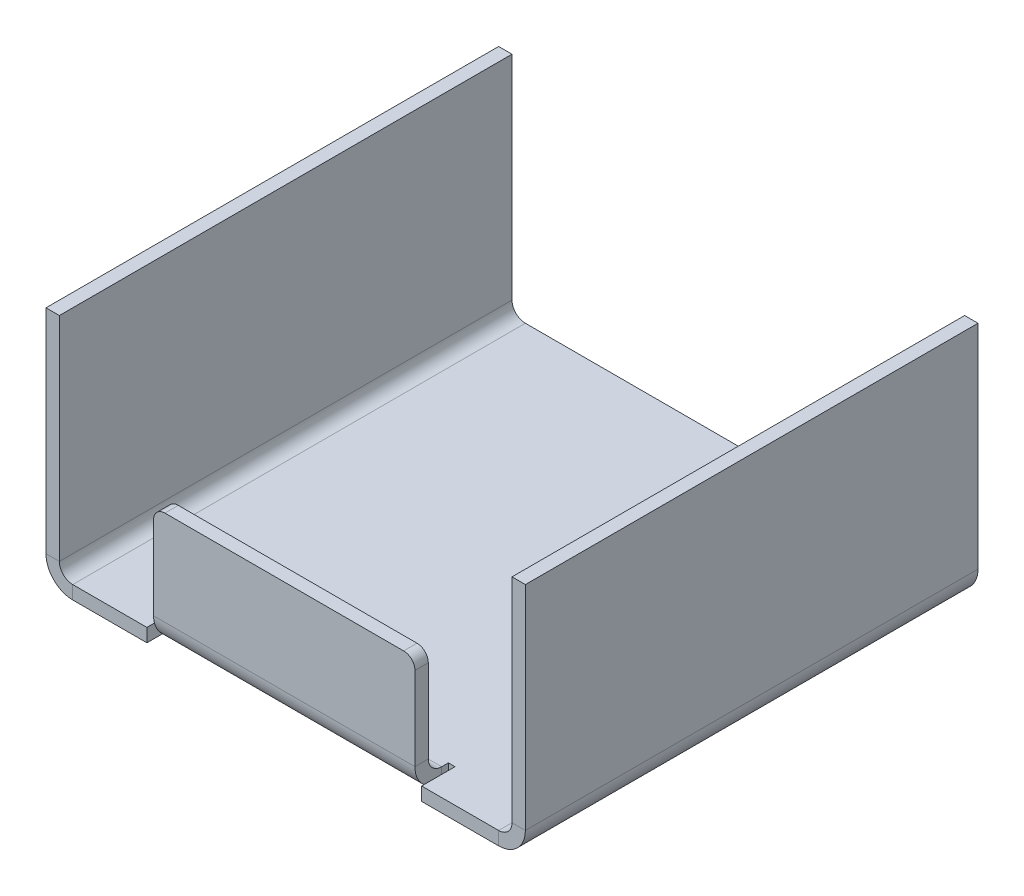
ISO-10303-21;
HEADER;
FILE_DESCRIPTION(('STEP AP214'),'2;1');
FILE_NAME('part.step','',(''),(''),'','','');
FILE_SCHEMA(('AUTOMOTIVE_DESIGN { 1 0 10303 214 1 1 1 1 }'));
ENDSEC;
DATA;
#1=APPLICATION_CONTEXT('core data for automotive mechanical design processes');
#2=APPLICATION_PROTOCOL_DEFINITION('international standard','automotive_design',2000,#1);
#3=PRODUCT_CONTEXT('',#1,'mechanical');
#4=PRODUCT('Part','Part','',(#3));
#5=PRODUCT_RELATED_PRODUCT_CATEGORY('part','',(#4));
#6=PRODUCT_DEFINITION_FORMATION('','',#4);
#7=PRODUCT_DEFINITION_CONTEXT('part definition',#1,'design');
#8=PRODUCT_DEFINITION('design','',#6,#7);
#9=PRODUCT_DEFINITION_SHAPE('','',#8);
#10=(LENGTH_UNIT() NAMED_UNIT(*) SI_UNIT(.MILLI.,.METRE.));
#11=(NAMED_UNIT(*) PLANE_ANGLE_UNIT() SI_UNIT($,.RADIAN.));
#12=(NAMED_UNIT(*) SI_UNIT($,.STERADIAN.) SOLID_ANGLE_UNIT());
#13=UNCERTAINTY_MEASURE_WITH_UNIT(LENGTH_MEASURE(1.E-05),#10,'distance_accuracy_value','');
#14=(GEOMETRIC_REPRESENTATION_CONTEXT(3) GLOBAL_UNCERTAINTY_ASSIGNED_CONTEXT((#13)) GLOBAL_UNIT_ASSIGNED_CONTEXT((#10,
#11,#12)) REPRESENTATION_CONTEXT('',''));
#15=CARTESIAN_POINT('',(0.,0.,0.));
#16=DIRECTION('',(0.,0.,1.));
#17=DIRECTION('',(1.,0.,0.));
#18=AXIS2_PLACEMENT_3D('',#15,#16,#17);
#19=CARTESIAN_POINT('',(-53.8,3.,50.8));
#20=DIRECTION('',(0.,0.,1.));
#21=DIRECTION('',(1.,0.,0.));
#22=AXIS2_PLACEMENT_3D('',#19,#20,#21);
#23=PLANE('',#22);
#24=DIRECTION('',(1.,0.,0.));
#25=VECTOR('',#24,1.);
#26=CARTESIAN_POINT('',(-50.8,0.,50.8));
#27=LINE('',#26,#25);
#28=CARTESIAN_POINT('',(30.5126051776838,0.,50.8));
#29=VERTEX_POINT('',#28);
#30=CARTESIAN_POINT('',(47.8,0.,50.8));
#31=VERTEX_POINT('',#30);
#32=EDGE_CURVE('E346',#29,#31,#27,.T.);
#33=ORIENTED_EDGE('',*,*,#32,.F.);
#34=DIRECTION('',(0.,-1.,0.));
#35=VECTOR('',#34,1.);
#36=CARTESIAN_POINT('',(30.5126051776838,0.,50.8));
#37=LINE('',#36,#35);
#38=CARTESIAN_POINT('',(30.5126051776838,-3.,50.8));
#39=VERTEX_POINT('',#38);
#40=EDGE_CURVE('E307',#29,#39,#37,.T.);
#41=ORIENTED_EDGE('',*,*,#40,.T.);
#42=DIRECTION('',(1.,0.,0.));
#43=VECTOR('',#42,1.);
#44=CARTESIAN_POINT('',(-50.8,-3.,50.8));
#45=LINE('',#44,#43);
#46=CARTESIAN_POINT('',(47.8,-3.,50.8));
#47=VERTEX_POINT('',#46);
#48=EDGE_CURVE('E365',#39,#47,#45,.T.);
#49=ORIENTED_EDGE('',*,*,#48,.T.);
#50=DIRECTION('',(0.,1.,0.));
#51=VECTOR('',#50,1.);
#52=CARTESIAN_POINT('',(47.8,-3.,50.8));
#53=LINE('',#52,#51);
#54=EDGE_CURVE('E442',#47,#31,#53,.T.);
#55=ORIENTED_EDGE('',*,*,#54,.T.);
#56=EDGE_LOOP('',(#33,#41,#49,#55));
#57=FACE_BOUND('',#56,.T.);
#58=ADVANCED_FACE('F59',(#57),#23,.T.);
#59=CARTESIAN_POINT('',(-47.8,-3.,50.8));
#60=VERTEX_POINT('',#59);
#61=CARTESIAN_POINT('',(-31.1512524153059,-3.,50.8));
#62=VERTEX_POINT('',#61);
#63=EDGE_CURVE('E366',#60,#62,#45,.T.);
#64=ORIENTED_EDGE('',*,*,#63,.T.);
#65=DIRECTION('',(0.,-1.,0.));
#66=VECTOR('',#65,1.);
#67=CARTESIAN_POINT('',(-31.1512524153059,0.,50.8));
#68=LINE('',#67,#66);
#69=CARTESIAN_POINT('',(-31.1512524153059,0.,50.8));
#70=VERTEX_POINT('',#69);
#71=EDGE_CURVE('E322',#70,#62,#68,.T.);
#72=ORIENTED_EDGE('',*,*,#71,.F.);
#73=CARTESIAN_POINT('',(-47.8,0.,50.8));
#74=VERTEX_POINT('',#73);
#75=EDGE_CURVE('E347',#74,#70,#27,.T.);
#76=ORIENTED_EDGE('',*,*,#75,.F.);
#77=DIRECTION('',(0.,-1.,0.));
#78=VECTOR('',#77,1.);
#79=CARTESIAN_POINT('',(-47.8,0.,50.8));
#80=LINE('',#79,#78);
#81=EDGE_CURVE('E453',#74,#60,#80,.T.);
#82=ORIENTED_EDGE('',*,*,#81,.T.);
#83=EDGE_LOOP('',(#64,#72,#76,#82));
#84=FACE_BOUND('',#83,.T.);
#85=ADVANCED_FACE('F524',(#84),#23,.T.);
#86=CARTESIAN_POINT('',(-50.8,0.,50.8));
#87=DIRECTION('',(0.,1.,0.));
#88=DIRECTION('',(0.,0.,1.));
#89=AXIS2_PLACEMENT_3D('',#86,#87,#88);
#90=PLANE('',#89);
#91=DIRECTION('',(-1.,0.,0.));
#92=VECTOR('',#91,1.);
#93=CARTESIAN_POINT('',(30.5126051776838,0.,43.3));
#94=LINE('',#93,#92);
#95=CARTESIAN_POINT('',(30.5126051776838,0.,43.3));
#96=VERTEX_POINT('',#95);
#97=CARTESIAN_POINT('',(29.0126051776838,0.,43.3));
#98=VERTEX_POINT('',#97);
#99=EDGE_CURVE('E74',#96,#98,#94,.T.);
#100=ORIENTED_EDGE('',*,*,#99,.F.);
#101=DIRECTION('',(0.,0.,-1.));
#102=VECTOR('',#101,1.);
#103=CARTESIAN_POINT('',(30.5126051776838,0.,50.8));
#104=LINE('',#103,#102);
#105=EDGE_CURVE('E303',#29,#96,#104,.T.);
#106=ORIENTED_EDGE('',*,*,#105,.F.);
#107=ORIENTED_EDGE('',*,*,#32,.T.);
#108=DIRECTION('',(0.,0.,-1.));
#109=VECTOR('',#108,1.);
#110=CARTESIAN_POINT('',(47.8,0.,50.8));
#111=LINE('',#110,#109);
#112=CARTESIAN_POINT('',(47.8,0.,-50.8));
#113=VERTEX_POINT('',#112);
#114=EDGE_CURVE('E428',#31,#113,#111,.T.);
#115=ORIENTED_EDGE('',*,*,#114,.T.);
#116=DIRECTION('',(1.,0.,0.));
#117=VECTOR('',#116,1.);
#118=CARTESIAN_POINT('',(-50.8,0.,-50.8));
#119=LINE('',#118,#117);
#120=CARTESIAN_POINT('',(-47.8,0.,-50.8));
#121=VERTEX_POINT('',#120);
#122=EDGE_CURVE('E384',#121,#113,#119,.T.);
#123=ORIENTED_EDGE('',*,*,#122,.F.);
#124=DIRECTION('',(0.,0.,-1.));
#125=VECTOR('',#124,1.);
#126=CARTESIAN_POINT('',(-47.8,0.,50.8));
#127=LINE('',#126,#125);
#128=EDGE_CURVE('E425',#74,#121,#127,.T.);
#129=ORIENTED_EDGE('',*,*,#128,.F.);
#130=ORIENTED_EDGE('',*,*,#75,.T.);
#131=DIRECTION('',(0.,0.,1.));
#132=VECTOR('',#131,1.);
#133=CARTESIAN_POINT('',(-31.1512524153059,0.,43.3));
#134=LINE('',#133,#132);
#135=CARTESIAN_POINT('',(-31.1512524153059,0.,43.3));
#136=VERTEX_POINT('',#135);
#137=EDGE_CURVE('E319',#136,#70,#134,.T.);
#138=ORIENTED_EDGE('',*,*,#137,.F.);
#139=DIRECTION('',(-1.,0.,0.));
#140=VECTOR('',#139,1.);
#141=CARTESIAN_POINT('',(-29.6512524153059,0.,43.3));
#142=LINE('',#141,#140);
#143=CARTESIAN_POINT('',(-29.6512524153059,0.,43.3));
#144=VERTEX_POINT('',#143);
#145=EDGE_CURVE('E315',#144,#136,#142,.T.);
#146=ORIENTED_EDGE('',*,*,#145,.F.);
#147=DIRECTION('',(0.,0.,-1.));
#148=VECTOR('',#147,1.);
#149=CARTESIAN_POINT('',(-29.6512524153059,0.,44.8));
#150=LINE('',#149,#148);
#151=CARTESIAN_POINT('',(-29.6512524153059,0.,44.8));
#152=VERTEX_POINT('',#151);
#153=EDGE_CURVE('E312',#152,#144,#150,.T.);
#154=ORIENTED_EDGE('',*,*,#153,.F.);
#155=DIRECTION('',(1.,0.,0.));
#156=VECTOR('',#155,1.);
#157=CARTESIAN_POINT('',(29.0126051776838,0.,44.8));
#158=LINE('',#157,#156);
#159=CARTESIAN_POINT('',(29.0126051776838,0.,44.8));
#160=VERTEX_POINT('',#159);
#161=EDGE_CURVE('E291',#160,#152,#158,.F.);
#162=ORIENTED_EDGE('',*,*,#161,.F.);
#163=DIRECTION('',(0.,0.,1.));
#164=VECTOR('',#163,1.);
#165=CARTESIAN_POINT('',(29.0126051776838,0.,43.3));
#166=LINE('',#165,#164);
#167=EDGE_CURVE('E79',#98,#160,#166,.T.);
#168=ORIENTED_EDGE('',*,*,#167,.F.);
#169=EDGE_LOOP('',(#100,#106,#107,#115,#123,#129,#130,#138,#146,#154,#162,#168));
#170=FACE_BOUND('',#169,.T.);
#171=ADVANCED_FACE('F475',(#170),#90,.T.);
#172=CARTESIAN_POINT('',(-50.8,-3.,50.8));
#173=DIRECTION('',(0.,1.,0.));
#174=DIRECTION('',(0.,0.,1.));
#175=AXIS2_PLACEMENT_3D('',#172,#173,#174);
#176=PLANE('',#175);
#177=DIRECTION('',(0.,0.,1.));
#178=VECTOR('',#177,1.);
#179=CARTESIAN_POINT('',(30.5126051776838,-3.,50.8));
#180=LINE('',#179,#178);
#181=CARTESIAN_POINT('',(30.5126051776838,-3.,43.3));
#182=VERTEX_POINT('',#181);
#183=EDGE_CURVE('E13',#182,#39,#180,.T.);
#184=ORIENTED_EDGE('',*,*,#183,.F.);
#185=DIRECTION('',(1.,0.,0.));
#186=VECTOR('',#185,1.);
#187=CARTESIAN_POINT('',(-50.8,-3.,43.3));
#188=LINE('',#187,#186);
#189=CARTESIAN_POINT('',(29.0126051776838,-3.,43.3));
#190=VERTEX_POINT('',#189);
#191=EDGE_CURVE('E67',#190,#182,#188,.T.);
#192=ORIENTED_EDGE('',*,*,#191,.F.);
#193=DIRECTION('',(0.,0.,-1.));
#194=VECTOR('',#193,1.);
#195=CARTESIAN_POINT('',(29.0126051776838,-3.,50.8));
#196=LINE('',#195,#194);
#197=CARTESIAN_POINT('',(29.0126051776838,-3.00000000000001,44.8));
#198=VERTEX_POINT('',#197);
#199=EDGE_CURVE('E464',#198,#190,#196,.T.);
#200=ORIENTED_EDGE('',*,*,#199,.F.);
#201=DIRECTION('',(1.,0.,0.));
#202=VECTOR('',#201,1.);
#203=CARTESIAN_POINT('',(29.0126051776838,-3.00000000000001,44.8));
#204=LINE('',#203,#202);
#205=CARTESIAN_POINT('',(-29.6512524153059,-3.,44.8));
#206=VERTEX_POINT('',#205);
#207=EDGE_CURVE('E279',#198,#206,#204,.F.);
#208=ORIENTED_EDGE('',*,*,#207,.T.);
#209=DIRECTION('',(0.,0.,1.));
#210=VECTOR('',#209,1.);
#211=CARTESIAN_POINT('',(-29.6512524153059,-3.,50.8));
#212=LINE('',#211,#210);
#213=CARTESIAN_POINT('',(-29.6512524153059,-3.,43.3));
#214=VERTEX_POINT('',#213);
#215=EDGE_CURVE('E461',#214,#206,#212,.T.);
#216=ORIENTED_EDGE('',*,*,#215,.F.);
#217=DIRECTION('',(1.,0.,0.));
#218=VECTOR('',#217,1.);
#219=CARTESIAN_POINT('',(-50.8,-3.,43.3));
#220=LINE('',#219,#218);
#221=CARTESIAN_POINT('',(-31.1512524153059,-3.,43.3));
#222=VERTEX_POINT('',#221);
#223=EDGE_CURVE('E458',#222,#214,#220,.T.);
#224=ORIENTED_EDGE('',*,*,#223,.F.);
#225=DIRECTION('',(0.,0.,-1.));
#226=VECTOR('',#225,1.);
#227=CARTESIAN_POINT('',(-31.1512524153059,-3.,50.8));
#228=LINE('',#227,#226);
#229=EDGE_CURVE('E455',#62,#222,#228,.T.);
#230=ORIENTED_EDGE('',*,*,#229,.F.);
#231=ORIENTED_EDGE('',*,*,#63,.F.);
#232=DIRECTION('',(0.,0.,-1.));
#233=VECTOR('',#232,1.);
#234=CARTESIAN_POINT('',(-47.8,-3.,50.8));
#235=LINE('',#234,#233);
#236=CARTESIAN_POINT('',(-47.8,-3.,-50.8));
#237=VERTEX_POINT('',#236);
#238=EDGE_CURVE('E412',#60,#237,#235,.T.);
#239=ORIENTED_EDGE('',*,*,#238,.T.);
#240=DIRECTION('',(1.,0.,0.));
#241=VECTOR('',#240,1.);
#242=CARTESIAN_POINT('',(-50.8,-3.,-50.8));
#243=LINE('',#242,#241);
#244=CARTESIAN_POINT('',(47.8,-3.,-50.8));
#245=VERTEX_POINT('',#244);
#246=EDGE_CURVE('E402',#237,#245,#243,.T.);
#247=ORIENTED_EDGE('',*,*,#246,.T.);
#248=DIRECTION('',(0.,0.,-1.));
#249=VECTOR('',#248,1.);
#250=CARTESIAN_POINT('',(47.8,-3.,50.8));
#251=LINE('',#250,#249);
#252=EDGE_CURVE('E409',#47,#245,#251,.T.);
#253=ORIENTED_EDGE('',*,*,#252,.F.);
#254=ORIENTED_EDGE('',*,*,#48,.F.);
#255=EDGE_LOOP('',(#184,#192,#200,#208,#216,#224,#230,#231,#239,#247,#253,#254));
#256=FACE_BOUND('',#255,.T.);
#257=ADVANCED_FACE('F688',(#256),#176,.F.);
#258=CARTESIAN_POINT('',(-47.8,0.,50.8));
#259=DIRECTION('',(0.,0.,1.));
#260=DIRECTION('',(1.,0.,0.));
#261=AXIS2_PLACEMENT_3D('',#258,#259,#260);
#262=PLANE('',#261);
#263=ORIENTED_EDGE('',*,*,#81,.F.);
#264=CARTESIAN_POINT('',(-47.8,3.,50.8));
#265=DIRECTION('',(0.,0.,-1.));
#266=DIRECTION('',(-1.,0.,0.));
#267=AXIS2_PLACEMENT_3D('',#264,#265,#266);
#268=CIRCLE('',#267,3.);
#269=CARTESIAN_POINT('',(-50.8,3.,50.8));
#270=VERTEX_POINT('',#269);
#271=EDGE_CURVE('E350',#270,#74,#268,.F.);
#272=ORIENTED_EDGE('',*,*,#271,.F.);
#273=DIRECTION('',(1.,0.,0.));
#274=VECTOR('',#273,1.);
#275=CARTESIAN_POINT('',(-53.8,3.,50.8));
#276=LINE('',#275,#274);
#277=CARTESIAN_POINT('',(-53.8,3.,50.8));
#278=VERTEX_POINT('',#277);
#279=EDGE_CURVE('E451',#278,#270,#276,.T.);
#280=ORIENTED_EDGE('',*,*,#279,.F.);
#281=CARTESIAN_POINT('',(-47.8,3.,50.8));
#282=DIRECTION('',(0.,0.,1.));
#283=DIRECTION('',(1.,0.,0.));
#284=AXIS2_PLACEMENT_3D('',#281,#282,#283);
#285=CIRCLE('',#284,6.);
#286=EDGE_CURVE('E362',#278,#60,#285,.T.);
#287=ORIENTED_EDGE('',*,*,#286,.T.);
#288=EDGE_LOOP('',(#263,#272,#280,#287));
#289=FACE_BOUND('',#288,.T.);
#290=ADVANCED_FACE('F61',(#289),#262,.T.);
#291=CARTESIAN_POINT('',(-50.8,3.,-50.8));
#292=DIRECTION('',(0.,0.,-1.));
#293=DIRECTION('',(-1.,0.,0.));
#294=AXIS2_PLACEMENT_3D('',#291,#292,#293);
#295=PLANE('',#294);
#296=DIRECTION('',(-1.,0.,0.));
#297=VECTOR('',#296,1.);
#298=CARTESIAN_POINT('',(-50.8,3.,-50.8));
#299=LINE('',#298,#297);
#300=CARTESIAN_POINT('',(-50.8,3.,-50.8));
#301=VERTEX_POINT('',#300);
#302=CARTESIAN_POINT('',(-53.8,3.,-50.8));
#303=VERTEX_POINT('',#302);
#304=EDGE_CURVE('E449',#301,#303,#299,.T.);
#305=ORIENTED_EDGE('',*,*,#304,.F.);
#306=CARTESIAN_POINT('',(-47.8,3.,-50.8));
#307=DIRECTION('',(0.,0.,-1.));
#308=DIRECTION('',(-1.,0.,0.));
#309=AXIS2_PLACEMENT_3D('',#306,#307,#308);
#310=CIRCLE('',#309,3.);
#311=EDGE_CURVE('E387',#301,#121,#310,.F.);
#312=ORIENTED_EDGE('',*,*,#311,.T.);
#313=DIRECTION('',(0.,1.,0.));
#314=VECTOR('',#313,1.);
#315=CARTESIAN_POINT('',(-47.8,-3.,-50.8));
#316=LINE('',#315,#314);
#317=EDGE_CURVE('E447',#237,#121,#316,.T.);
#318=ORIENTED_EDGE('',*,*,#317,.F.);
#319=CARTESIAN_POINT('',(-47.8,3.,-50.8));
#320=DIRECTION('',(0.,0.,1.));
#321=DIRECTION('',(1.,0.,0.));
#322=AXIS2_PLACEMENT_3D('',#319,#320,#321);
#323=CIRCLE('',#322,6.);
#324=EDGE_CURVE('E399',#303,#237,#323,.T.);
#325=ORIENTED_EDGE('',*,*,#324,.F.);
#326=EDGE_LOOP('',(#305,#312,#318,#325));
#327=FACE_BOUND('',#326,.T.);
#328=ADVANCED_FACE('F530',(#327),#295,.T.);
#329=CARTESIAN_POINT('',(-47.8,-3.,-50.8));
#330=DIRECTION('',(0.,0.,-1.));
#331=DIRECTION('',(-1.,0.,0.));
#332=AXIS2_PLACEMENT_3D('',#329,#330,#331);
#333=PLANE('',#332);
#334=DIRECTION('',(0.,-1.,0.));
#335=VECTOR('',#334,1.);
#336=CARTESIAN_POINT('',(-50.8,50.8,-50.8));
#337=LINE('',#336,#335);
#338=CARTESIAN_POINT('',(-50.8,50.8,-50.8));
#339=VERTEX_POINT('',#338);
#340=EDGE_CURVE('E390',#339,#301,#337,.T.);
#341=ORIENTED_EDGE('',*,*,#340,.T.);
#342=ORIENTED_EDGE('',*,*,#304,.T.);
#343=DIRECTION('',(0.,1.,0.));
#344=VECTOR('',#343,1.);
#345=CARTESIAN_POINT('',(-53.8,50.8,-50.8));
#346=LINE('',#345,#344);
#347=CARTESIAN_POINT('',(-53.8,50.8,-50.8));
#348=VERTEX_POINT('',#347);
#349=EDGE_CURVE('E396',#348,#303,#346,.F.);
#350=ORIENTED_EDGE('',*,*,#349,.F.);
#351=DIRECTION('',(1.,0.,0.));
#352=VECTOR('',#351,1.);
#353=CARTESIAN_POINT('',(-53.8,50.8,-50.8));
#354=LINE('',#353,#352);
#355=EDGE_CURVE('E393',#348,#339,#354,.T.);
#356=ORIENTED_EDGE('',*,*,#355,.T.);
#357=EDGE_LOOP('',(#341,#342,#350,#356));
#358=FACE_BOUND('',#357,.T.);
#359=ADVANCED_FACE('F533',(#358),#333,.T.);
#360=CARTESIAN_POINT('',(50.8,3.,50.8));
#361=DIRECTION('',(0.,0.,1.));
#362=DIRECTION('',(1.,0.,0.));
#363=AXIS2_PLACEMENT_3D('',#360,#361,#362);
#364=PLANE('',#363);
#365=DIRECTION('',(1.,0.,0.));
#366=VECTOR('',#365,1.);
#367=CARTESIAN_POINT('',(50.8,3.,50.8));
#368=LINE('',#367,#366);
#369=CARTESIAN_POINT('',(50.8,3.,50.8));
#370=VERTEX_POINT('',#369);
#371=CARTESIAN_POINT('',(53.8,3.,50.8));
#372=VERTEX_POINT('',#371);
#373=EDGE_CURVE('E445',#370,#372,#368,.T.);
#374=ORIENTED_EDGE('',*,*,#373,.F.);
#375=CARTESIAN_POINT('',(47.8,3.,50.8));
#376=DIRECTION('',(0.,0.,-1.));
#377=DIRECTION('',(-1.,0.,0.));
#378=AXIS2_PLACEMENT_3D('',#375,#376,#377);
#379=CIRCLE('',#378,3.);
#380=EDGE_CURVE('E343',#31,#370,#379,.F.);
#381=ORIENTED_EDGE('',*,*,#380,.F.);
#382=ORIENTED_EDGE('',*,*,#54,.F.);
#383=CARTESIAN_POINT('',(47.8,3.,50.8));
#384=DIRECTION('',(0.,0.,1.));
#385=DIRECTION('',(1.,0.,0.));
#386=AXIS2_PLACEMENT_3D('',#383,#384,#385);
#387=CIRCLE('',#386,6.);
#388=EDGE_CURVE('E369',#47,#372,#387,.T.);
#389=ORIENTED_EDGE('',*,*,#388,.T.);
#390=EDGE_LOOP('',(#374,#381,#382,#389));
#391=FACE_BOUND('',#390,.T.);
#392=ADVANCED_FACE('F487',(#391),#364,.T.);
#393=CARTESIAN_POINT('',(47.8,-3.,50.8));
#394=DIRECTION('',(0.,0.,1.));
#395=DIRECTION('',(1.,0.,0.));
#396=AXIS2_PLACEMENT_3D('',#393,#394,#395);
#397=PLANE('',#396);
#398=DIRECTION('',(0.,1.,0.));
#399=VECTOR('',#398,1.);
#400=CARTESIAN_POINT('',(50.8,0.,50.8));
#401=LINE('',#400,#399);
#402=CARTESIAN_POINT('',(50.8,50.8,50.8));
#403=VERTEX_POINT('',#402);
#404=EDGE_CURVE('E340',#370,#403,#401,.T.);
#405=ORIENTED_EDGE('',*,*,#404,.F.);
#406=ORIENTED_EDGE('',*,*,#373,.T.);
#407=DIRECTION('',(0.,1.,0.));
#408=VECTOR('',#407,1.);
#409=CARTESIAN_POINT('',(53.8,0.,50.8));
#410=LINE('',#409,#408);
#411=CARTESIAN_POINT('',(53.8,50.8,50.8));
#412=VERTEX_POINT('',#411);
#413=EDGE_CURVE('E334',#372,#412,#410,.T.);
#414=ORIENTED_EDGE('',*,*,#413,.T.);
#415=DIRECTION('',(1.,0.,0.));
#416=VECTOR('',#415,1.);
#417=CARTESIAN_POINT('',(50.8,50.8,50.8));
#418=LINE('',#417,#416);
#419=EDGE_CURVE('E336',#403,#412,#418,.T.);
#420=ORIENTED_EDGE('',*,*,#419,.F.);
#421=EDGE_LOOP('',(#405,#406,#414,#420));
#422=FACE_BOUND('',#421,.T.);
#423=ADVANCED_FACE('F497',(#422),#397,.T.);
#424=CARTESIAN_POINT('',(47.8,0.,-50.8));
#425=DIRECTION('',(0.,0.,-1.));
#426=DIRECTION('',(-1.,0.,0.));
#427=AXIS2_PLACEMENT_3D('',#424,#425,#426);
#428=PLANE('',#427);
#429=DIRECTION('',(0.,-1.,0.));
#430=VECTOR('',#429,1.);
#431=CARTESIAN_POINT('',(47.8,0.,-50.8));
#432=LINE('',#431,#430);
#433=EDGE_CURVE('E440',#113,#245,#432,.T.);
#434=ORIENTED_EDGE('',*,*,#433,.F.);
#435=CARTESIAN_POINT('',(47.8,3.,-50.8));
#436=DIRECTION('',(0.,0.,-1.));
#437=DIRECTION('',(-1.,0.,0.));
#438=AXIS2_PLACEMENT_3D('',#435,#436,#437);
#439=CIRCLE('',#438,3.);
#440=CARTESIAN_POINT('',(50.8,3.,-50.8));
#441=VERTEX_POINT('',#440);
#442=EDGE_CURVE('E381',#113,#441,#439,.F.);
#443=ORIENTED_EDGE('',*,*,#442,.T.);
#444=DIRECTION('',(-1.,0.,0.));
#445=VECTOR('',#444,1.);
#446=CARTESIAN_POINT('',(53.8,3.,-50.8));
#447=LINE('',#446,#445);
#448=CARTESIAN_POINT('',(53.8,3.,-50.8));
#449=VERTEX_POINT('',#448);
#450=EDGE_CURVE('E438',#449,#441,#447,.T.);
#451=ORIENTED_EDGE('',*,*,#450,.F.);
#452=CARTESIAN_POINT('',(47.8,3.,-50.8));
#453=DIRECTION('',(0.,0.,1.));
#454=DIRECTION('',(1.,0.,0.));
#455=AXIS2_PLACEMENT_3D('',#452,#453,#454);
#456=CIRCLE('',#455,6.);
#457=EDGE_CURVE('E337',#245,#449,#456,.T.);
#458=ORIENTED_EDGE('',*,*,#457,.F.);
#459=EDGE_LOOP('',(#434,#443,#451,#458));
#460=FACE_BOUND('',#459,.T.);
#461=ADVANCED_FACE('F508',(#460),#428,.T.);
#462=CARTESIAN_POINT('',(53.8,3.,-50.8));
#463=DIRECTION('',(0.,0.,-1.));
#464=DIRECTION('',(-1.,0.,0.));
#465=AXIS2_PLACEMENT_3D('',#462,#463,#464);
#466=PLANE('',#465);
#467=ORIENTED_EDGE('',*,*,#122,.T.);
#468=ORIENTED_EDGE('',*,*,#433,.T.);
#469=ORIENTED_EDGE('',*,*,#246,.F.);
#470=ORIENTED_EDGE('',*,*,#317,.T.);
#471=EDGE_LOOP('',(#467,#468,#469,#470));
#472=FACE_BOUND('',#471,.T.);
#473=ADVANCED_FACE('F514',(#472),#466,.T.);
#474=CARTESIAN_POINT('',(53.8,0.,50.8));
#475=DIRECTION('',(-1.,0.,0.));
#476=DIRECTION('',(0.,0.,1.));
#477=AXIS2_PLACEMENT_3D('',#474,#475,#476);
#478=PLANE('',#477);
#479=DIRECTION('',(0.,1.,0.));
#480=VECTOR('',#479,1.);
#481=CARTESIAN_POINT('',(53.8,0.,-50.8));
#482=LINE('',#481,#480);
#483=CARTESIAN_POINT('',(53.8,50.8,-50.8));
#484=VERTEX_POINT('',#483);
#485=EDGE_CURVE('E306',#449,#484,#482,.T.);
#486=ORIENTED_EDGE('',*,*,#485,.T.);
#487=DIRECTION('',(0.,0.,-1.));
#488=VECTOR('',#487,1.);
#489=CARTESIAN_POINT('',(53.8,50.8,50.8));
#490=LINE('',#489,#488);
#491=EDGE_CURVE('E436',#412,#484,#490,.T.);
#492=ORIENTED_EDGE('',*,*,#491,.F.);
#493=ORIENTED_EDGE('',*,*,#413,.F.);
#494=DIRECTION('',(0.,0.,-1.));
#495=VECTOR('',#494,1.);
#496=CARTESIAN_POINT('',(53.8,3.,50.8));
#497=LINE('',#496,#495);
#498=EDGE_CURVE('E372',#372,#449,#497,.T.);
#499=ORIENTED_EDGE('',*,*,#498,.T.);
#500=EDGE_LOOP('',(#486,#492,#493,#499));
#501=FACE_BOUND('',#500,.T.);
#502=ADVANCED_FACE('F512',(#501),#478,.F.);
#503=CARTESIAN_POINT('',(50.8,50.8,50.8));
#504=DIRECTION('',(0.,1.,0.));
#505=DIRECTION('',(0.,0.,1.));
#506=AXIS2_PLACEMENT_3D('',#503,#504,#505);
#507=PLANE('',#506);
#508=DIRECTION('',(1.,0.,0.));
#509=VECTOR('',#508,1.);
#510=CARTESIAN_POINT('',(50.8,50.8,-50.8));
#511=LINE('',#510,#509);
#512=CARTESIAN_POINT('',(50.8,50.8,-50.8));
#513=VERTEX_POINT('',#512);
#514=EDGE_CURVE('E375',#513,#484,#511,.T.);
#515=ORIENTED_EDGE('',*,*,#514,.F.);
#516=DIRECTION('',(0.,0.,-1.));
#517=VECTOR('',#516,1.);
#518=CARTESIAN_POINT('',(50.8,50.8,50.8));
#519=LINE('',#518,#517);
#520=EDGE_CURVE('E434',#403,#513,#519,.T.);
#521=ORIENTED_EDGE('',*,*,#520,.F.);
#522=ORIENTED_EDGE('',*,*,#419,.T.);
#523=ORIENTED_EDGE('',*,*,#491,.T.);
#524=EDGE_LOOP('',(#515,#521,#522,#523));
#525=FACE_BOUND('',#524,.T.);
#526=ADVANCED_FACE('F502',(#525),#507,.T.);
#527=CARTESIAN_POINT('',(50.8,0.,50.8));
#528=DIRECTION('',(-1.,0.,0.));
#529=DIRECTION('',(0.,0.,1.));
#530=AXIS2_PLACEMENT_3D('',#527,#528,#529);
#531=PLANE('',#530);
#532=DIRECTION('',(0.,1.,0.));
#533=VECTOR('',#532,1.);
#534=CARTESIAN_POINT('',(50.8,0.,-50.8));
#535=LINE('',#534,#533);
#536=EDGE_CURVE('E378',#441,#513,#535,.T.);
#537=ORIENTED_EDGE('',*,*,#536,.F.);
#538=DIRECTION('',(0.,0.,-1.));
#539=VECTOR('',#538,1.);
#540=CARTESIAN_POINT('',(50.8,3.,50.8));
#541=LINE('',#540,#539);
#542=EDGE_CURVE('E431',#370,#441,#541,.T.);
#543=ORIENTED_EDGE('',*,*,#542,.F.);
#544=ORIENTED_EDGE('',*,*,#404,.T.);
#545=ORIENTED_EDGE('',*,*,#520,.T.);
#546=EDGE_LOOP('',(#537,#543,#544,#545));
#547=FACE_BOUND('',#546,.T.);
#548=ADVANCED_FACE('F495',(#547),#531,.T.);
#549=CARTESIAN_POINT('',(47.8,3.,50.8));
#550=DIRECTION('',(0.,0.,-1.));
#551=DIRECTION('',(-1.,0.,0.));
#552=AXIS2_PLACEMENT_3D('',#549,#550,#551);
#553=CYLINDRICAL_SURFACE('',#552,3.);
#554=ORIENTED_EDGE('',*,*,#442,.F.);
#555=ORIENTED_EDGE('',*,*,#114,.F.);
#556=ORIENTED_EDGE('',*,*,#380,.T.);
#557=ORIENTED_EDGE('',*,*,#542,.T.);
#558=EDGE_LOOP('',(#554,#555,#556,#557));
#559=FACE_BOUND('',#558,.T.);
#560=ADVANCED_FACE('F485',(#559),#553,.F.);
#561=CARTESIAN_POINT('',(-47.8,3.,50.8));
#562=DIRECTION('',(0.,0.,-1.));
#563=DIRECTION('',(-1.,0.,0.));
#564=AXIS2_PLACEMENT_3D('',#561,#562,#563);
#565=CYLINDRICAL_SURFACE('',#564,3.);
#566=ORIENTED_EDGE('',*,*,#311,.F.);
#567=DIRECTION('',(0.,0.,-1.));
#568=VECTOR('',#567,1.);
#569=CARTESIAN_POINT('',(-50.8,3.,50.8));
#570=LINE('',#569,#568);
#571=EDGE_CURVE('E422',#270,#301,#570,.T.);
#572=ORIENTED_EDGE('',*,*,#571,.F.);
#573=ORIENTED_EDGE('',*,*,#271,.T.);
#574=ORIENTED_EDGE('',*,*,#128,.T.);
#575=EDGE_LOOP('',(#566,#572,#573,#574));
#576=FACE_BOUND('',#575,.T.);
#577=ADVANCED_FACE('F582',(#576),#565,.F.);
#578=CARTESIAN_POINT('',(-50.8,50.8,50.8));
#579=DIRECTION('',(1.,0.,0.));
#580=DIRECTION('',(0.,0.,-1.));
#581=AXIS2_PLACEMENT_3D('',#578,#579,#580);
#582=PLANE('',#581);
#583=ORIENTED_EDGE('',*,*,#340,.F.);
#584=DIRECTION('',(0.,0.,-1.));
#585=VECTOR('',#584,1.);
#586=CARTESIAN_POINT('',(-50.8,50.8,50.8));
#587=LINE('',#586,#585);
#588=CARTESIAN_POINT('',(-50.8,50.8,50.8));
#589=VERTEX_POINT('',#588);
#590=EDGE_CURVE('E420',#589,#339,#587,.T.);
#591=ORIENTED_EDGE('',*,*,#590,.F.);
#592=DIRECTION('',(0.,-1.,0.));
#593=VECTOR('',#592,1.);
#594=CARTESIAN_POINT('',(-50.8,50.8,50.8));
#595=LINE('',#594,#593);
#596=EDGE_CURVE('E353',#589,#270,#595,.T.);
#597=ORIENTED_EDGE('',*,*,#596,.T.);
#598=ORIENTED_EDGE('',*,*,#571,.T.);
#599=EDGE_LOOP('',(#583,#591,#597,#598));
#600=FACE_BOUND('',#599,.T.);
#601=ADVANCED_FACE('F592',(#600),#582,.T.);
#602=CARTESIAN_POINT('',(-53.8,50.8,50.8));
#603=DIRECTION('',(0.,1.,0.));
#604=DIRECTION('',(0.,0.,1.));
#605=AXIS2_PLACEMENT_3D('',#602,#603,#604);
#606=PLANE('',#605);
#607=ORIENTED_EDGE('',*,*,#355,.F.);
#608=DIRECTION('',(0.,0.,-1.));
#609=VECTOR('',#608,1.);
#610=CARTESIAN_POINT('',(-53.8,50.8,50.8));
#611=LINE('',#610,#609);
#612=CARTESIAN_POINT('',(-53.8,50.8,50.8));
#613=VERTEX_POINT('',#612);
#614=EDGE_CURVE('E418',#613,#348,#611,.T.);
#615=ORIENTED_EDGE('',*,*,#614,.F.);
#616=DIRECTION('',(1.,0.,0.));
#617=VECTOR('',#616,1.);
#618=CARTESIAN_POINT('',(-53.8,50.8,50.8));
#619=LINE('',#618,#617);
#620=EDGE_CURVE('E356',#613,#589,#619,.T.);
#621=ORIENTED_EDGE('',*,*,#620,.T.);
#622=ORIENTED_EDGE('',*,*,#590,.T.);
#623=EDGE_LOOP('',(#607,#615,#621,#622));
#624=FACE_BOUND('',#623,.T.);
#625=ADVANCED_FACE('F603',(#624),#606,.T.);
#626=CARTESIAN_POINT('',(-53.8,50.8,50.8));
#627=DIRECTION('',(1.,0.,0.));
#628=DIRECTION('',(0.,0.,-1.));
#629=AXIS2_PLACEMENT_3D('',#626,#627,#628);
#630=PLANE('',#629);
#631=ORIENTED_EDGE('',*,*,#349,.T.);
#632=DIRECTION('',(0.,0.,-1.));
#633=VECTOR('',#632,1.);
#634=CARTESIAN_POINT('',(-53.8,3.,50.8));
#635=LINE('',#634,#633);
#636=EDGE_CURVE('E415',#278,#303,#635,.T.);
#637=ORIENTED_EDGE('',*,*,#636,.F.);
#638=DIRECTION('',(0.,1.,0.));
#639=VECTOR('',#638,1.);
#640=CARTESIAN_POINT('',(-53.8,50.8,50.8));
#641=LINE('',#640,#639);
#642=EDGE_CURVE('E359',#613,#278,#641,.F.);
#643=ORIENTED_EDGE('',*,*,#642,.F.);
#644=ORIENTED_EDGE('',*,*,#614,.T.);
#645=EDGE_LOOP('',(#631,#637,#643,#644));
#646=FACE_BOUND('',#645,.T.);
#647=ADVANCED_FACE('F614',(#646),#630,.F.);
#648=CARTESIAN_POINT('',(-47.8,3.,50.8));
#649=DIRECTION('',(0.,0.,-1.));
#650=DIRECTION('',(-1.,0.,0.));
#651=AXIS2_PLACEMENT_3D('',#648,#649,#650);
#652=CYLINDRICAL_SURFACE('',#651,6.);
#653=ORIENTED_EDGE('',*,*,#324,.T.);
#654=ORIENTED_EDGE('',*,*,#238,.F.);
#655=ORIENTED_EDGE('',*,*,#286,.F.);
#656=ORIENTED_EDGE('',*,*,#636,.T.);
#657=EDGE_LOOP('',(#653,#654,#655,#656));
#658=FACE_BOUND('',#657,.T.);
#659=ADVANCED_FACE('F625',(#658),#652,.T.);
#660=CARTESIAN_POINT('',(47.8,3.,50.8));
#661=DIRECTION('',(0.,0.,-1.));
#662=DIRECTION('',(-1.,0.,0.));
#663=AXIS2_PLACEMENT_3D('',#660,#661,#662);
#664=CYLINDRICAL_SURFACE('',#663,6.);
#665=ORIENTED_EDGE('',*,*,#457,.T.);
#666=ORIENTED_EDGE('',*,*,#498,.F.);
#667=ORIENTED_EDGE('',*,*,#388,.F.);
#668=ORIENTED_EDGE('',*,*,#252,.T.);
#669=EDGE_LOOP('',(#665,#666,#667,#668));
#670=FACE_BOUND('',#669,.T.);
#671=ADVANCED_FACE('F510',(#670),#664,.T.);
#672=CARTESIAN_POINT('',(47.8,3.,50.8));
#673=DIRECTION('',(0.,0.,-1.));
#674=DIRECTION('',(-1.,0.,0.));
#675=AXIS2_PLACEMENT_3D('',#672,#673,#674);
#676=PLANE('',#675);
#677=ORIENTED_EDGE('',*,*,#642,.T.);
#678=ORIENTED_EDGE('',*,*,#279,.T.);
#679=ORIENTED_EDGE('',*,*,#596,.F.);
#680=ORIENTED_EDGE('',*,*,#620,.F.);
#681=EDGE_LOOP('',(#677,#678,#679,#680));
#682=FACE_BOUND('',#681,.T.);
#683=ADVANCED_FACE('F646',(#682),#676,.F.);
#684=CARTESIAN_POINT('',(47.8,3.,-50.8));
#685=DIRECTION('',(0.,0.,-1.));
#686=DIRECTION('',(-1.,0.,0.));
#687=AXIS2_PLACEMENT_3D('',#684,#685,#686);
#688=PLANE('',#687);
#689=ORIENTED_EDGE('',*,*,#485,.F.);
#690=ORIENTED_EDGE('',*,*,#450,.T.);
#691=ORIENTED_EDGE('',*,*,#536,.T.);
#692=ORIENTED_EDGE('',*,*,#514,.T.);
#693=EDGE_LOOP('',(#689,#690,#691,#692));
#694=FACE_BOUND('',#693,.T.);
#695=ADVANCED_FACE('F505',(#694),#688,.T.);
#696=CARTESIAN_POINT('',(30.5126051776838,0.,50.8));
#697=DIRECTION('',(-1.,0.,0.));
#698=DIRECTION('',(0.,0.,1.));
#699=AXIS2_PLACEMENT_3D('',#696,#697,#698);
#700=PLANE('',#699);
#701=DIRECTION('',(0.,-1.,0.));
#702=VECTOR('',#701,1.);
#703=CARTESIAN_POINT('',(30.5126051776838,0.,43.3));
#704=LINE('',#703,#702);
#705=EDGE_CURVE('E309',#96,#182,#704,.T.);
#706=ORIENTED_EDGE('',*,*,#705,.T.);
#707=ORIENTED_EDGE('',*,*,#183,.T.);
#708=ORIENTED_EDGE('',*,*,#40,.F.);
#709=ORIENTED_EDGE('',*,*,#105,.T.);
#710=EDGE_LOOP('',(#706,#707,#708,#709));
#711=FACE_BOUND('',#710,.T.);
#712=ADVANCED_FACE('F472',(#711),#700,.T.);
#713=CARTESIAN_POINT('',(30.5126051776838,0.,43.3));
#714=DIRECTION('',(0.,0.,1.));
#715=DIRECTION('',(0.,-1.,0.));
#716=AXIS2_PLACEMENT_3D('',#713,#714,#715);
#717=PLANE('',#716);
#718=DIRECTION('',(0.,-1.,0.));
#719=VECTOR('',#718,1.);
#720=CARTESIAN_POINT('',(29.0126051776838,0.,43.3));
#721=LINE('',#720,#719);
#722=EDGE_CURVE('E311',#98,#190,#721,.T.);
#723=ORIENTED_EDGE('',*,*,#722,.T.);
#724=ORIENTED_EDGE('',*,*,#191,.T.);
#725=ORIENTED_EDGE('',*,*,#705,.F.);
#726=ORIENTED_EDGE('',*,*,#99,.T.);
#727=EDGE_LOOP('',(#723,#724,#725,#726));
#728=FACE_BOUND('',#727,.T.);
#729=ADVANCED_FACE('F468',(#728),#717,.T.);
#730=CARTESIAN_POINT('',(29.0126051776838,0.,43.3));
#731=DIRECTION('',(1.,0.,0.));
#732=DIRECTION('',(0.,0.,-1.));
#733=AXIS2_PLACEMENT_3D('',#730,#731,#732);
#734=PLANE('',#733);
#735=DIRECTION('',(0.,-1.,0.));
#736=VECTOR('',#735,1.);
#737=CARTESIAN_POINT('',(29.0126051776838,0.,44.8));
#738=LINE('',#737,#736);
#739=EDGE_CURVE('E285',#160,#198,#738,.T.);
#740=ORIENTED_EDGE('',*,*,#739,.T.);
#741=ORIENTED_EDGE('',*,*,#199,.T.);
#742=ORIENTED_EDGE('',*,*,#722,.F.);
#743=ORIENTED_EDGE('',*,*,#167,.T.);
#744=EDGE_LOOP('',(#740,#741,#742,#743));
#745=FACE_BOUND('',#744,.T.);
#746=ADVANCED_FACE('F714',(#745),#734,.T.);
#747=CARTESIAN_POINT('',(-29.6512524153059,0.,44.8));
#748=DIRECTION('',(-1.,0.,0.));
#749=DIRECTION('',(0.,0.,1.));
#750=AXIS2_PLACEMENT_3D('',#747,#748,#749);
#751=PLANE('',#750);
#752=DIRECTION('',(0.,-1.,0.));
#753=VECTOR('',#752,1.);
#754=CARTESIAN_POINT('',(-29.6512524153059,0.,43.3));
#755=LINE('',#754,#753);
#756=EDGE_CURVE('E318',#144,#214,#755,.T.);
#757=ORIENTED_EDGE('',*,*,#756,.T.);
#758=ORIENTED_EDGE('',*,*,#215,.T.);
#759=DIRECTION('',(0.,-1.,0.));
#760=VECTOR('',#759,1.);
#761=CARTESIAN_POINT('',(-29.6512524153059,0.,44.8));
#762=LINE('',#761,#760);
#763=EDGE_CURVE('E298',#152,#206,#762,.T.);
#764=ORIENTED_EDGE('',*,*,#763,.F.);
#765=ORIENTED_EDGE('',*,*,#153,.T.);
#766=EDGE_LOOP('',(#757,#758,#764,#765));
#767=FACE_BOUND('',#766,.T.);
#768=ADVANCED_FACE('F724',(#767),#751,.T.);
#769=CARTESIAN_POINT('',(-29.6512524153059,0.,43.3));
#770=DIRECTION('',(0.,0.,1.));
#771=DIRECTION('',(0.,-1.,0.));
#772=AXIS2_PLACEMENT_3D('',#769,#770,#771);
#773=PLANE('',#772);
#774=DIRECTION('',(0.,-1.,0.));
#775=VECTOR('',#774,1.);
#776=CARTESIAN_POINT('',(-31.1512524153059,0.,43.3));
#777=LINE('',#776,#775);
#778=EDGE_CURVE('E301',#136,#222,#777,.T.);
#779=ORIENTED_EDGE('',*,*,#778,.T.);
#780=ORIENTED_EDGE('',*,*,#223,.T.);
#781=ORIENTED_EDGE('',*,*,#756,.F.);
#782=ORIENTED_EDGE('',*,*,#145,.T.);
#783=EDGE_LOOP('',(#779,#780,#781,#782));
#784=FACE_BOUND('',#783,.T.);
#785=ADVANCED_FACE('F735',(#784),#773,.T.);
#786=CARTESIAN_POINT('',(-31.1512524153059,0.,43.3));
#787=DIRECTION('',(1.,0.,0.));
#788=DIRECTION('',(0.,0.,-1.));
#789=AXIS2_PLACEMENT_3D('',#786,#787,#788);
#790=PLANE('',#789);
#791=ORIENTED_EDGE('',*,*,#71,.T.);
#792=ORIENTED_EDGE('',*,*,#229,.T.);
#793=ORIENTED_EDGE('',*,*,#778,.F.);
#794=ORIENTED_EDGE('',*,*,#137,.T.);
#795=EDGE_LOOP('',(#791,#792,#793,#794));
#796=FACE_BOUND('',#795,.T.);
#797=ADVANCED_FACE('F746',(#796),#790,.T.);
#798=CARTESIAN_POINT('',(-29.6512524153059,2.99999999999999,44.8));
#799=DIRECTION('',(-1.,0.,0.));
#800=DIRECTION('',(0.,0.,1.));
#801=AXIS2_PLACEMENT_3D('',#798,#799,#800);
#802=PLANE('',#801);
#803=DIRECTION('',(0.,0.,-1.));
#804=VECTOR('',#803,1.);
#805=CARTESIAN_POINT('',(-29.6512524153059,2.99999999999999,50.8));
#806=LINE('',#805,#804);
#807=CARTESIAN_POINT('',(-29.6512524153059,2.99999999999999,47.8));
#808=VERTEX_POINT('',#807);
#809=CARTESIAN_POINT('',(-29.6512524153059,2.99999999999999,50.8));
#810=VERTEX_POINT('',#809);
#811=EDGE_CURVE('E255',#808,#810,#806,.F.);
#812=ORIENTED_EDGE('',*,*,#811,.F.);
#813=CARTESIAN_POINT('',(-29.6512524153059,2.99999999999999,44.8));
#814=DIRECTION('',(1.,0.,0.));
#815=DIRECTION('',(0.,0.,-1.));
#816=AXIS2_PLACEMENT_3D('',#813,#814,#815);
#817=CIRCLE('',#816,3.);
#818=EDGE_CURVE('E288',#152,#808,#817,.F.);
#819=ORIENTED_EDGE('',*,*,#818,.F.);
#820=ORIENTED_EDGE('',*,*,#763,.T.);
#821=CARTESIAN_POINT('',(-29.6512524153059,2.99999999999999,44.8));
#822=DIRECTION('',(1.,0.,0.));
#823=DIRECTION('',(0.,0.,-1.));
#824=AXIS2_PLACEMENT_3D('',#821,#822,#823);
#825=CIRCLE('',#824,6.);
#826=EDGE_CURVE('E281',#206,#810,#825,.F.);
#827=ORIENTED_EDGE('',*,*,#826,.T.);
#828=EDGE_LOOP('',(#812,#819,#820,#827));
#829=FACE_BOUND('',#828,.T.);
#830=ADVANCED_FACE('F757',(#829),#802,.T.);
#831=CARTESIAN_POINT('',(29.0126051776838,2.99999999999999,44.8));
#832=DIRECTION('',(-1.,0.,0.));
#833=DIRECTION('',(0.,0.,1.));
#834=AXIS2_PLACEMENT_3D('',#831,#832,#833);
#835=PLANE('',#834);
#836=CARTESIAN_POINT('',(29.0126051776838,2.99999999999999,44.8));
#837=DIRECTION('',(1.,0.,0.));
#838=DIRECTION('',(0.,0.,-1.));
#839=AXIS2_PLACEMENT_3D('',#836,#837,#838);
#840=CIRCLE('',#839,3.);
#841=CARTESIAN_POINT('',(29.0126051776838,2.99999999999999,47.8));
#842=VERTEX_POINT('',#841);
#843=EDGE_CURVE('E294',#842,#160,#840,.T.);
#844=ORIENTED_EDGE('',*,*,#843,.F.);
#845=DIRECTION('',(0.,0.,-1.));
#846=VECTOR('',#845,1.);
#847=CARTESIAN_POINT('',(29.0126051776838,2.99999999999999,47.8));
#848=LINE('',#847,#846);
#849=CARTESIAN_POINT('',(29.0126051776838,2.99999999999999,50.8));
#850=VERTEX_POINT('',#849);
#851=EDGE_CURVE('E273',#842,#850,#848,.F.);
#852=ORIENTED_EDGE('',*,*,#851,.T.);
#853=CARTESIAN_POINT('',(29.0126051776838,2.99999999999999,44.8));
#854=DIRECTION('',(1.,0.,0.));
#855=DIRECTION('',(0.,0.,-1.));
#856=AXIS2_PLACEMENT_3D('',#853,#854,#855);
#857=CIRCLE('',#856,6.);
#858=EDGE_CURVE('E282',#850,#198,#857,.T.);
#859=ORIENTED_EDGE('',*,*,#858,.T.);
#860=ORIENTED_EDGE('',*,*,#739,.F.);
#861=EDGE_LOOP('',(#844,#852,#859,#860));
#862=FACE_BOUND('',#861,.T.);
#863=ADVANCED_FACE('F767',(#862),#835,.F.);
#864=CARTESIAN_POINT('',(29.0126051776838,2.99999999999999,44.8));
#865=DIRECTION('',(1.,0.,0.));
#866=DIRECTION('',(0.,0.,1.));
#867=AXIS2_PLACEMENT_3D('',#864,#865,#866);
#868=CYLINDRICAL_SURFACE('',#867,6.);
#869=ORIENTED_EDGE('',*,*,#207,.F.);
#870=ORIENTED_EDGE('',*,*,#858,.F.);
#871=DIRECTION('',(1.,0.,0.));
#872=VECTOR('',#871,1.);
#873=CARTESIAN_POINT('',(-29.6512524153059,2.99999999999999,50.8));
#874=LINE('',#873,#872);
#875=EDGE_CURVE('E271',#850,#810,#874,.F.);
#876=ORIENTED_EDGE('',*,*,#875,.T.);
#877=ORIENTED_EDGE('',*,*,#826,.F.);
#878=EDGE_LOOP('',(#869,#870,#876,#877));
#879=FACE_BOUND('',#878,.T.);
#880=ADVANCED_FACE('F770',(#879),#868,.T.);
#881=CARTESIAN_POINT('',(29.0126051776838,2.99999999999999,44.8));
#882=DIRECTION('',(1.,0.,0.));
#883=DIRECTION('',(0.,0.,1.));
#884=AXIS2_PLACEMENT_3D('',#881,#882,#883);
#885=CYLINDRICAL_SURFACE('',#884,3.);
#886=ORIENTED_EDGE('',*,*,#161,.T.);
#887=ORIENTED_EDGE('',*,*,#818,.T.);
#888=DIRECTION('',(1.,0.,0.));
#889=VECTOR('',#888,1.);
#890=CARTESIAN_POINT('',(-29.6512524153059,2.99999999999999,47.8));
#891=LINE('',#890,#889);
#892=EDGE_CURVE('E276',#808,#842,#891,.T.);
#893=ORIENTED_EDGE('',*,*,#892,.T.);
#894=ORIENTED_EDGE('',*,*,#843,.T.);
#895=EDGE_LOOP('',(#886,#887,#893,#894));
#896=FACE_BOUND('',#895,.T.);
#897=ADVANCED_FACE('F781',(#896),#885,.F.);
#898=CARTESIAN_POINT('',(-29.6512524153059,0.,50.8));
#899=DIRECTION('',(1.,0.,0.));
#900=DIRECTION('',(0.,0.,-1.));
#901=AXIS2_PLACEMENT_3D('',#898,#899,#900);
#902=PLANE('',#901);
#903=ORIENTED_EDGE('',*,*,#811,.T.);
#904=DIRECTION('',(0.,-1.,0.));
#905=VECTOR('',#904,1.);
#906=CARTESIAN_POINT('',(-29.6512524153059,21.7,50.8));
#907=LINE('',#906,#905);
#908=CARTESIAN_POINT('',(-29.6512524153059,21.7,50.8));
#909=VERTEX_POINT('',#908);
#910=EDGE_CURVE('E236',#909,#810,#907,.T.);
#911=ORIENTED_EDGE('',*,*,#910,.F.);
#912=DIRECTION('',(0.,0.,-1.));
#913=VECTOR('',#912,1.);
#914=CARTESIAN_POINT('',(-29.6512524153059,21.7,50.8));
#915=LINE('',#914,#913);
#916=CARTESIAN_POINT('',(-29.6512524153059,21.7,47.8));
#917=VERTEX_POINT('',#916);
#918=EDGE_CURVE('E242',#909,#917,#915,.T.);
#919=ORIENTED_EDGE('',*,*,#918,.T.);
#920=DIRECTION('',(0.,1.,0.));
#921=VECTOR('',#920,1.);
#922=CARTESIAN_POINT('',(-29.6512524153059,0.,47.8));
#923=LINE('',#922,#921);
#924=EDGE_CURVE('E269',#917,#808,#923,.F.);
#925=ORIENTED_EDGE('',*,*,#924,.T.);
#926=EDGE_LOOP('',(#903,#911,#919,#925));
#927=FACE_BOUND('',#926,.T.);
#928=ADVANCED_FACE('F254',(#927),#902,.F.);
#929=CARTESIAN_POINT('',(29.0126051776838,21.7,50.8));
#930=DIRECTION('',(-1.,0.,0.));
#931=DIRECTION('',(0.,0.,1.));
#932=AXIS2_PLACEMENT_3D('',#929,#930,#931);
#933=PLANE('',#932);
#934=ORIENTED_EDGE('',*,*,#851,.F.);
#935=DIRECTION('',(0.,-1.,0.));
#936=VECTOR('',#935,1.);
#937=CARTESIAN_POINT('',(29.0126051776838,21.7,47.8));
#938=LINE('',#937,#936);
#939=CARTESIAN_POINT('',(29.0126051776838,21.7,47.8));
#940=VERTEX_POINT('',#939);
#941=EDGE_CURVE('E267',#842,#940,#938,.F.);
#942=ORIENTED_EDGE('',*,*,#941,.T.);
#943=DIRECTION('',(0.,0.,-1.));
#944=VECTOR('',#943,1.);
#945=CARTESIAN_POINT('',(29.0126051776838,21.7,50.8));
#946=LINE('',#945,#944);
#947=CARTESIAN_POINT('',(29.0126051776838,21.7,50.8));
#948=VERTEX_POINT('',#947);
#949=EDGE_CURVE('E297',#948,#940,#946,.T.);
#950=ORIENTED_EDGE('',*,*,#949,.F.);
#951=DIRECTION('',(0.,1.,0.));
#952=VECTOR('',#951,1.);
#953=CARTESIAN_POINT('',(29.0126051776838,21.7,50.8));
#954=LINE('',#953,#952);
#955=EDGE_CURVE('E256',#850,#948,#954,.T.);
#956=ORIENTED_EDGE('',*,*,#955,.F.);
#957=EDGE_LOOP('',(#934,#942,#950,#956));
#958=FACE_BOUND('',#957,.T.);
#959=ADVANCED_FACE('F810',(#958),#933,.F.);
#960=CARTESIAN_POINT('',(-27.1112524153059,21.7,50.8));
#961=DIRECTION('',(0.,0.,-1.));
#962=DIRECTION('',(-1.,0.,0.));
#963=AXIS2_PLACEMENT_3D('',#960,#961,#962);
#964=PLANE('',#963);
#965=ORIENTED_EDGE('',*,*,#875,.F.);
#966=ORIENTED_EDGE('',*,*,#955,.T.);
#967=CARTESIAN_POINT('',(26.4726051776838,21.7,50.8));
#968=DIRECTION('',(0.,0.,-1.));
#969=DIRECTION('',(-1.,0.,0.));
#970=AXIS2_PLACEMENT_3D('',#967,#968,#969);
#971=CIRCLE('',#970,2.54);
#972=CARTESIAN_POINT('',(26.4726051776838,24.24,50.8));
#973=VERTEX_POINT('',#972);
#974=EDGE_CURVE('E258',#948,#973,#971,.F.);
#975=ORIENTED_EDGE('',*,*,#974,.T.);
#976=DIRECTION('',(-1.,0.,0.));
#977=VECTOR('',#976,1.);
#978=CARTESIAN_POINT('',(-27.1112524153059,24.24,50.8));
#979=LINE('',#978,#977);
#980=CARTESIAN_POINT('',(-27.1112524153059,24.24,50.8));
#981=VERTEX_POINT('',#980);
#982=EDGE_CURVE('E238',#973,#981,#979,.T.);
#983=ORIENTED_EDGE('',*,*,#982,.T.);
#984=CARTESIAN_POINT('',(-27.1112524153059,21.7,50.8));
#985=DIRECTION('',(0.,0.,-1.));
#986=DIRECTION('',(-1.,0.,0.));
#987=AXIS2_PLACEMENT_3D('',#984,#985,#986);
#988=CIRCLE('',#987,2.54);
#989=EDGE_CURVE('E231',#981,#909,#988,.F.);
#990=ORIENTED_EDGE('',*,*,#989,.T.);
#991=ORIENTED_EDGE('',*,*,#910,.T.);
#992=EDGE_LOOP('',(#965,#966,#975,#983,#990,#991));
#993=FACE_BOUND('',#992,.T.);
#994=ADVANCED_FACE('F234',(#993),#964,.F.);
#995=CARTESIAN_POINT('',(-27.1112524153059,21.7,47.8));
#996=DIRECTION('',(0.,0.,-1.));
#997=DIRECTION('',(-1.,0.,0.));
#998=AXIS2_PLACEMENT_3D('',#995,#996,#997);
#999=PLANE('',#998);
#1000=ORIENTED_EDGE('',*,*,#941,.F.);
#1001=ORIENTED_EDGE('',*,*,#892,.F.);
#1002=ORIENTED_EDGE('',*,*,#924,.F.);
#1003=CARTESIAN_POINT('',(-27.1112524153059,21.7,47.8));
#1004=DIRECTION('',(0.,0.,-1.));
#1005=DIRECTION('',(-1.,0.,0.));
#1006=AXIS2_PLACEMENT_3D('',#1003,#1004,#1005);
#1007=CIRCLE('',#1006,2.54);
#1008=CARTESIAN_POINT('',(-27.1112524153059,24.24,47.8));
#1009=VERTEX_POINT('',#1008);
#1010=EDGE_CURVE('E247',#1009,#917,#1007,.F.);
#1011=ORIENTED_EDGE('',*,*,#1010,.F.);
#1012=DIRECTION('',(1.,0.,0.));
#1013=VECTOR('',#1012,1.);
#1014=CARTESIAN_POINT('',(-27.1112524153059,24.24,47.8));
#1015=LINE('',#1014,#1013);
#1016=CARTESIAN_POINT('',(26.4726051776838,24.24,47.8));
#1017=VERTEX_POINT('',#1016);
#1018=EDGE_CURVE('E260',#1017,#1009,#1015,.F.);
#1019=ORIENTED_EDGE('',*,*,#1018,.F.);
#1020=CARTESIAN_POINT('',(26.4726051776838,21.7,47.8));
#1021=DIRECTION('',(0.,0.,-1.));
#1022=DIRECTION('',(-1.,0.,0.));
#1023=AXIS2_PLACEMENT_3D('',#1020,#1021,#1022);
#1024=CIRCLE('',#1023,2.54);
#1025=EDGE_CURVE('E265',#940,#1017,#1024,.F.);
#1026=ORIENTED_EDGE('',*,*,#1025,.F.);
#1027=EDGE_LOOP('',(#1000,#1001,#1002,#1011,#1019,#1026));
#1028=FACE_BOUND('',#1027,.T.);
#1029=ADVANCED_FACE('F830',(#1028),#999,.T.);
#1030=CARTESIAN_POINT('',(26.4726051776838,21.7,50.8));
#1031=DIRECTION('',(0.,0.,-1.));
#1032=DIRECTION('',(-1.,0.,0.));
#1033=AXIS2_PLACEMENT_3D('',#1030,#1031,#1032);
#1034=CYLINDRICAL_SURFACE('',#1033,2.54);
#1035=ORIENTED_EDGE('',*,*,#1025,.T.);
#1036=DIRECTION('',(0.,0.,-1.));
#1037=VECTOR('',#1036,1.);
#1038=CARTESIAN_POINT('',(26.4726051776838,24.24,50.8));
#1039=LINE('',#1038,#1037);
#1040=EDGE_CURVE('E896',#973,#1017,#1039,.T.);
#1041=ORIENTED_EDGE('',*,*,#1040,.F.);
#1042=ORIENTED_EDGE('',*,*,#974,.F.);
#1043=ORIENTED_EDGE('',*,*,#949,.T.);
#1044=EDGE_LOOP('',(#1035,#1041,#1042,#1043));
#1045=FACE_BOUND('',#1044,.T.);
#1046=ADVANCED_FACE('F840',(#1045),#1034,.T.);
#1047=CARTESIAN_POINT('',(-27.1112524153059,24.24,50.8));
#1048=DIRECTION('',(0.,-1.,0.));
#1049=DIRECTION('',(0.,0.,-1.));
#1050=AXIS2_PLACEMENT_3D('',#1047,#1048,#1049);
#1051=PLANE('',#1050);
#1052=ORIENTED_EDGE('',*,*,#1018,.T.);
#1053=DIRECTION('',(0.,0.,-1.));
#1054=VECTOR('',#1053,1.);
#1055=CARTESIAN_POINT('',(-27.1112524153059,24.24,50.8));
#1056=LINE('',#1055,#1054);
#1057=EDGE_CURVE('E251',#981,#1009,#1056,.T.);
#1058=ORIENTED_EDGE('',*,*,#1057,.F.);
#1059=ORIENTED_EDGE('',*,*,#982,.F.);
#1060=ORIENTED_EDGE('',*,*,#1040,.T.);
#1061=EDGE_LOOP('',(#1052,#1058,#1059,#1060));
#1062=FACE_BOUND('',#1061,.T.);
#1063=ADVANCED_FACE('F851',(#1062),#1051,.F.);
#1064=CARTESIAN_POINT('',(-27.1112524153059,21.7,50.8));
#1065=DIRECTION('',(0.,0.,-1.));
#1066=DIRECTION('',(-1.,0.,0.));
#1067=AXIS2_PLACEMENT_3D('',#1064,#1065,#1066);
#1068=CYLINDRICAL_SURFACE('',#1067,2.54);
#1069=ORIENTED_EDGE('',*,*,#1010,.T.);
#1070=ORIENTED_EDGE('',*,*,#918,.F.);
#1071=ORIENTED_EDGE('',*,*,#989,.F.);
#1072=ORIENTED_EDGE('',*,*,#1057,.T.);
#1073=EDGE_LOOP('',(#1069,#1070,#1071,#1072));
#1074=FACE_BOUND('',#1073,.T.);
#1075=ADVANCED_FACE('F245',(#1074),#1068,.T.);
#1076=CLOSED_SHELL('',(#58,#85,#171,#257,#290,#328,#359,#392,#423,#461,#473,#502,#526,#548,#560,
#577,#601,#625,#647,#659,#671,#683,#695,#712,#729,#746,#768,#785,#797,#830,#863,#880,#897,#928,
#959,#994,#1029,#1046,#1063,#1075));
#1077=MANIFOLD_SOLID_BREP('B2',#1076);
#1078=ADVANCED_BREP_SHAPE_REPRESENTATION('',(#18,#1077),#14);
#1079=SHAPE_DEFINITION_REPRESENTATION(#9,#1078);
ENDSEC;
END-ISO-10303-21;
